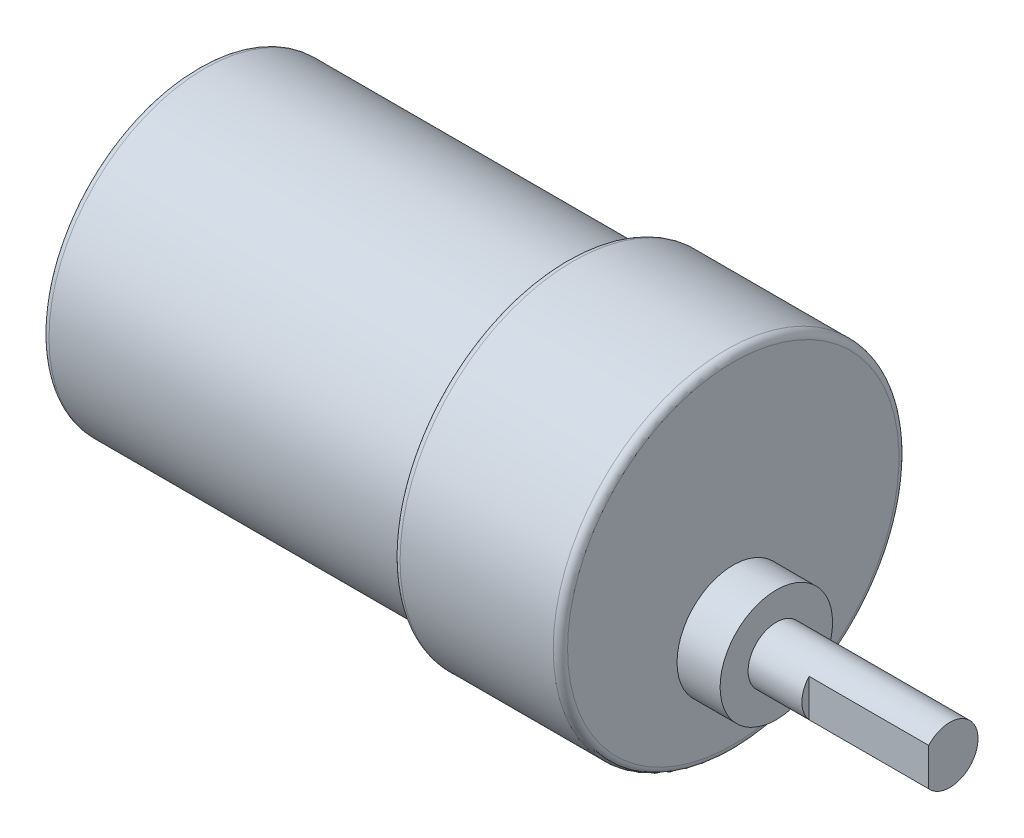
ISO-10303-21;
HEADER;
FILE_DESCRIPTION(('STEP AP214'),'2;1');
FILE_NAME('part.step','',(''),(''),'','','');
FILE_SCHEMA(('AUTOMOTIVE_DESIGN { 1 0 10303 214 1 1 1 1 }'));
ENDSEC;
DATA;
#1=APPLICATION_CONTEXT('core data for automotive mechanical design processes');
#2=APPLICATION_PROTOCOL_DEFINITION('international standard','automotive_design',2000,#1);
#3=PRODUCT_CONTEXT('',#1,'mechanical');
#4=PRODUCT('Part','Part','',(#3));
#5=PRODUCT_RELATED_PRODUCT_CATEGORY('part','',(#4));
#6=PRODUCT_DEFINITION_FORMATION('','',#4);
#7=PRODUCT_DEFINITION_CONTEXT('part definition',#1,'design');
#8=PRODUCT_DEFINITION('design','',#6,#7);
#9=PRODUCT_DEFINITION_SHAPE('','',#8);
#10=(LENGTH_UNIT() NAMED_UNIT(*) SI_UNIT(.MILLI.,.METRE.));
#11=(NAMED_UNIT(*) PLANE_ANGLE_UNIT() SI_UNIT($,.RADIAN.));
#12=(NAMED_UNIT(*) SI_UNIT($,.STERADIAN.) SOLID_ANGLE_UNIT());
#13=UNCERTAINTY_MEASURE_WITH_UNIT(LENGTH_MEASURE(1.E-05),#10,'distance_accuracy_value','');
#14=(GEOMETRIC_REPRESENTATION_CONTEXT(3) GLOBAL_UNCERTAINTY_ASSIGNED_CONTEXT((#13)) GLOBAL_UNIT_ASSIGNED_CONTEXT((#10,
#11,#12)) REPRESENTATION_CONTEXT('',''));
#15=CARTESIAN_POINT('',(0.,0.,0.));
#16=DIRECTION('',(0.,0.,1.));
#17=DIRECTION('',(1.,0.,0.));
#18=AXIS2_PLACEMENT_3D('',#15,#16,#17);
#19=CARTESIAN_POINT('',(61.468,-7.0358,0.));
#20=DIRECTION('',(1.,0.,0.));
#21=DIRECTION('',(0.,0.,-1.));
#22=AXIS2_PLACEMENT_3D('',#19,#20,#21);
#23=PLANE('',#22);
#24=CARTESIAN_POINT('',(61.468,-7.0358,0.));
#25=DIRECTION('',(1.,0.,0.));
#26=DIRECTION('',(0.,0.,-1.));
#27=AXIS2_PLACEMENT_3D('',#24,#25,#26);
#28=CIRCLE('',#27,5.969);
#29=CARTESIAN_POINT('',(61.468,-7.0358,-5.969));
#30=VERTEX_POINT('',#29);
#31=EDGE_CURVE('E72',#30,#30,#28,.T.);
#32=ORIENTED_EDGE('',*,*,#31,.T.);
#33=EDGE_LOOP('',(#32));
#34=FACE_BOUND('',#33,.T.);
#35=CARTESIAN_POINT('',(61.468,-7.0358,0.));
#36=DIRECTION('',(1.,0.,0.));
#37=DIRECTION('',(0.,0.,-1.));
#38=AXIS2_PLACEMENT_3D('',#35,#36,#37);
#39=CIRCLE('',#38,3.);
#40=CARTESIAN_POINT('',(61.468,-7.0358,-3.));
#41=VERTEX_POINT('',#40);
#42=EDGE_CURVE('E73',#41,#41,#39,.T.);
#43=ORIENTED_EDGE('',*,*,#42,.F.);
#44=EDGE_LOOP('',(#43));
#45=FACE_BOUND('',#44,.T.);
#46=ADVANCED_FACE('F34',(#34,#45),#23,.T.);
#47=CARTESIAN_POINT('',(56.896,18.3515,0.));
#48=DIRECTION('',(-1.,0.,0.));
#49=DIRECTION('',(0.,0.,1.));
#50=AXIS2_PLACEMENT_3D('',#47,#48,#49);
#51=PLANE('',#50);
#52=CARTESIAN_POINT('',(56.896,0.,0.));
#53=DIRECTION('',(-1.,0.,0.));
#54=DIRECTION('',(0.,0.,1.));
#55=AXIS2_PLACEMENT_3D('',#52,#53,#54);
#56=CIRCLE('',#55,17.5895);
#57=CARTESIAN_POINT('',(56.896,0.,17.5895));
#58=VERTEX_POINT('',#57);
#59=EDGE_CURVE('E96',#58,#58,#56,.F.);
#60=ORIENTED_EDGE('',*,*,#59,.T.);
#61=EDGE_LOOP('',(#60));
#62=FACE_BOUND('',#61,.T.);
#63=CARTESIAN_POINT('',(56.896,-7.0358,0.));
#64=DIRECTION('',(-1.,0.,0.));
#65=DIRECTION('',(0.,0.,1.));
#66=AXIS2_PLACEMENT_3D('',#63,#64,#65);
#67=CIRCLE('',#66,5.969);
#68=CARTESIAN_POINT('',(56.896,-7.0358,5.969));
#69=VERTEX_POINT('',#68);
#70=EDGE_CURVE('E87',#69,#69,#67,.F.);
#71=ORIENTED_EDGE('',*,*,#70,.F.);
#72=EDGE_LOOP('',(#71));
#73=FACE_BOUND('',#72,.T.);
#74=ADVANCED_FACE('F138',(#62,#73),#51,.F.);
#75=CARTESIAN_POINT('',(-2.286,0.,0.));
#76=DIRECTION('',(-1.,0.,0.));
#77=DIRECTION('',(0.,0.,1.));
#78=AXIS2_PLACEMENT_3D('',#75,#76,#77);
#79=CYLINDRICAL_SURFACE('',#78,16.51);
#80=CARTESIAN_POINT('',(0.762000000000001,0.,0.));
#81=DIRECTION('',(1.,0.,0.));
#82=DIRECTION('',(0.,0.,-1.));
#83=AXIS2_PLACEMENT_3D('',#80,#81,#82);
#84=CIRCLE('',#83,16.51);
#85=CARTESIAN_POINT('',(0.762000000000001,0.,-16.51));
#86=VERTEX_POINT('',#85);
#87=EDGE_CURVE('E105',#86,#86,#84,.T.);
#88=ORIENTED_EDGE('',*,*,#87,.T.);
#89=EDGE_LOOP('',(#88));
#90=FACE_BOUND('',#89,.T.);
#91=CARTESIAN_POINT('',(39.116,0.,0.));
#92=DIRECTION('',(-1.,0.,0.));
#93=DIRECTION('',(0.,0.,1.));
#94=AXIS2_PLACEMENT_3D('',#91,#92,#93);
#95=CIRCLE('',#94,16.51);
#96=CARTESIAN_POINT('',(39.116,0.,16.51));
#97=VERTEX_POINT('',#96);
#98=EDGE_CURVE('E76',#97,#97,#95,.T.);
#99=ORIENTED_EDGE('',*,*,#98,.T.);
#100=EDGE_LOOP('',(#99));
#101=FACE_BOUND('',#100,.T.);
#102=ADVANCED_FACE('F144',(#90,#101),#79,.T.);
#103=CARTESIAN_POINT('',(0.,3.175,0.));
#104=DIRECTION('',(1.,0.,0.));
#105=DIRECTION('',(0.,0.,-1.));
#106=AXIS2_PLACEMENT_3D('',#103,#104,#105);
#107=PLANE('',#106);
#108=CARTESIAN_POINT('',(0.,0.,0.));
#109=DIRECTION('',(1.,0.,0.));
#110=DIRECTION('',(0.,0.,-1.));
#111=AXIS2_PLACEMENT_3D('',#108,#109,#110);
#112=CIRCLE('',#111,15.748);
#113=CARTESIAN_POINT('',(0.,0.,-15.748));
#114=VERTEX_POINT('',#113);
#115=EDGE_CURVE('E102',#114,#114,#112,.F.);
#116=ORIENTED_EDGE('',*,*,#115,.T.);
#117=EDGE_LOOP('',(#116));
#118=FACE_BOUND('',#117,.T.);
#119=CARTESIAN_POINT('',(0.,0.,0.));
#120=DIRECTION('',(-1.,0.,0.));
#121=DIRECTION('',(0.,0.,1.));
#122=AXIS2_PLACEMENT_3D('',#119,#120,#121);
#123=CIRCLE('',#122,3.175);
#124=CARTESIAN_POINT('',(0.,0.,3.175));
#125=VERTEX_POINT('',#124);
#126=EDGE_CURVE('E84',#125,#125,#123,.T.);
#127=ORIENTED_EDGE('',*,*,#126,.F.);
#128=EDGE_LOOP('',(#127));
#129=FACE_BOUND('',#128,.T.);
#130=ADVANCED_FACE('F134',(#118,#129),#107,.F.);
#131=CARTESIAN_POINT('',(-2.286,0.,0.));
#132=DIRECTION('',(-1.,0.,0.));
#133=DIRECTION('',(0.,0.,1.));
#134=AXIS2_PLACEMENT_3D('',#131,#132,#133);
#135=CYLINDRICAL_SURFACE('',#134,3.175);
#136=CARTESIAN_POINT('',(-1.524,0.,0.));
#137=DIRECTION('',(1.,0.,0.));
#138=DIRECTION('',(0.,0.,-1.));
#139=AXIS2_PLACEMENT_3D('',#136,#137,#138);
#140=CIRCLE('',#139,3.175);
#141=CARTESIAN_POINT('',(-1.524,0.,-3.175));
#142=VERTEX_POINT('',#141);
#143=EDGE_CURVE('E64',#142,#142,#140,.T.);
#144=ORIENTED_EDGE('',*,*,#143,.T.);
#145=EDGE_LOOP('',(#144));
#146=FACE_BOUND('',#145,.T.);
#147=ORIENTED_EDGE('',*,*,#126,.T.);
#148=EDGE_LOOP('',(#147));
#149=FACE_BOUND('',#148,.T.);
#150=ADVANCED_FACE('F114',(#146,#149),#135,.T.);
#151=CARTESIAN_POINT('',(-2.286,3.175,0.));
#152=DIRECTION('',(1.,0.,0.));
#153=DIRECTION('',(0.,0.,-1.));
#154=AXIS2_PLACEMENT_3D('',#151,#152,#153);
#155=PLANE('',#154);
#156=CARTESIAN_POINT('',(-2.286,0.,0.));
#157=DIRECTION('',(1.,0.,0.));
#158=DIRECTION('',(0.,0.,-1.));
#159=AXIS2_PLACEMENT_3D('',#156,#157,#158);
#160=CIRCLE('',#159,2.413);
#161=CARTESIAN_POINT('',(-2.286,0.,-2.413));
#162=VERTEX_POINT('',#161);
#163=EDGE_CURVE('E108',#162,#162,#160,.F.);
#164=ORIENTED_EDGE('',*,*,#163,.T.);
#165=EDGE_LOOP('',(#164));
#166=FACE_BOUND('',#165,.T.);
#167=ADVANCED_FACE('F123',(#166),#155,.F.);
#168=CARTESIAN_POINT('',(-2.286,0.,0.));
#169=DIRECTION('',(-1.,0.,0.));
#170=DIRECTION('',(0.,0.,1.));
#171=AXIS2_PLACEMENT_3D('',#168,#169,#170);
#172=CYLINDRICAL_SURFACE('',#171,18.3515);
#173=CARTESIAN_POINT('',(56.134,0.,0.));
#174=DIRECTION('',(-1.,0.,0.));
#175=DIRECTION('',(0.,0.,1.));
#176=AXIS2_PLACEMENT_3D('',#173,#174,#175);
#177=CIRCLE('',#176,18.3515);
#178=CARTESIAN_POINT('',(56.134,0.,18.3515));
#179=VERTEX_POINT('',#178);
#180=EDGE_CURVE('E93',#179,#179,#177,.T.);
#181=ORIENTED_EDGE('',*,*,#180,.T.);
#182=EDGE_LOOP('',(#181));
#183=FACE_BOUND('',#182,.T.);
#184=CARTESIAN_POINT('',(39.878,0.,0.));
#185=DIRECTION('',(1.,0.,0.));
#186=DIRECTION('',(0.,0.,-1.));
#187=AXIS2_PLACEMENT_3D('',#184,#185,#186);
#188=CIRCLE('',#187,18.3515);
#189=CARTESIAN_POINT('',(39.878,0.,-18.3515));
#190=VERTEX_POINT('',#189);
#191=EDGE_CURVE('E90',#190,#190,#188,.T.);
#192=ORIENTED_EDGE('',*,*,#191,.T.);
#193=EDGE_LOOP('',(#192));
#194=FACE_BOUND('',#193,.T.);
#195=ADVANCED_FACE('F125',(#183,#194),#172,.T.);
#196=CARTESIAN_POINT('',(39.116,16.51,0.));
#197=DIRECTION('',(1.,0.,0.));
#198=DIRECTION('',(0.,0.,-1.));
#199=AXIS2_PLACEMENT_3D('',#196,#197,#198);
#200=PLANE('',#199);
#201=CARTESIAN_POINT('',(39.116,0.,0.));
#202=DIRECTION('',(1.,0.,0.));
#203=DIRECTION('',(0.,0.,-1.));
#204=AXIS2_PLACEMENT_3D('',#201,#202,#203);
#205=CIRCLE('',#204,17.5895);
#206=CARTESIAN_POINT('',(39.116,0.,-17.5895));
#207=VERTEX_POINT('',#206);
#208=EDGE_CURVE('E99',#207,#207,#205,.F.);
#209=ORIENTED_EDGE('',*,*,#208,.T.);
#210=EDGE_LOOP('',(#209));
#211=FACE_BOUND('',#210,.T.);
#212=ORIENTED_EDGE('',*,*,#98,.F.);
#213=EDGE_LOOP('',(#212));
#214=FACE_BOUND('',#213,.T.);
#215=ADVANCED_FACE('F131',(#211,#214),#200,.F.);
#216=CARTESIAN_POINT('',(61.468,-7.0358,0.));
#217=DIRECTION('',(-1.,0.,0.));
#218=DIRECTION('',(0.,0.,1.));
#219=AXIS2_PLACEMENT_3D('',#216,#217,#218);
#220=CYLINDRICAL_SURFACE('',#219,5.969);
#221=ORIENTED_EDGE('',*,*,#31,.F.);
#222=EDGE_LOOP('',(#221));
#223=FACE_BOUND('',#222,.T.);
#224=ORIENTED_EDGE('',*,*,#70,.T.);
#225=EDGE_LOOP('',(#224));
#226=FACE_BOUND('',#225,.T.);
#227=ADVANCED_FACE('F150',(#223,#226),#220,.T.);
#228=CARTESIAN_POINT('',(79.883,-7.0358,0.));
#229=DIRECTION('',(-1.,0.,0.));
#230=DIRECTION('',(0.,0.,1.));
#231=AXIS2_PLACEMENT_3D('',#228,#229,#230);
#232=CYLINDRICAL_SURFACE('',#231,3.);
#233=DIRECTION('',(-1.,0.,0.));
#234=VECTOR('',#233,1.);
#235=CARTESIAN_POINT('',(79.883,-9.03363783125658,2.238));
#236=LINE('',#235,#234);
#237=CARTESIAN_POINT('',(79.883,-9.03363783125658,2.238));
#238=VERTEX_POINT('',#237);
#239=CARTESIAN_POINT('',(67.183,-9.03363783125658,2.238));
#240=VERTEX_POINT('',#239);
#241=EDGE_CURVE('E49',#238,#240,#236,.T.);
#242=ORIENTED_EDGE('',*,*,#241,.T.);
#243=CARTESIAN_POINT('',(67.183,-7.0358,0.));
#244=DIRECTION('',(-1.,0.,0.));
#245=DIRECTION('',(0.,0.,1.));
#246=AXIS2_PLACEMENT_3D('',#243,#244,#245);
#247=CIRCLE('',#246,3.);
#248=CARTESIAN_POINT('',(67.183,-5.03796216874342,2.238));
#249=VERTEX_POINT('',#248);
#250=EDGE_CURVE('E11',#240,#249,#247,.T.);
#251=ORIENTED_EDGE('',*,*,#250,.T.);
#252=DIRECTION('',(-1.,0.,0.));
#253=VECTOR('',#252,1.);
#254=CARTESIAN_POINT('',(79.883,-5.03796216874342,2.238));
#255=LINE('',#254,#253);
#256=CARTESIAN_POINT('',(79.883,-5.03796216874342,2.238));
#257=VERTEX_POINT('',#256);
#258=EDGE_CURVE('E54',#249,#257,#255,.F.);
#259=ORIENTED_EDGE('',*,*,#258,.T.);
#260=CARTESIAN_POINT('',(79.883,-7.0358,0.));
#261=DIRECTION('',(1.,0.,0.));
#262=DIRECTION('',(0.,0.,-1.));
#263=AXIS2_PLACEMENT_3D('',#260,#261,#262);
#264=CIRCLE('',#263,3.);
#265=EDGE_CURVE('E68',#238,#257,#264,.T.);
#266=ORIENTED_EDGE('',*,*,#265,.F.);
#267=EDGE_LOOP('',(#242,#251,#259,#266));
#268=FACE_BOUND('',#267,.T.);
#269=ORIENTED_EDGE('',*,*,#42,.T.);
#270=EDGE_LOOP('',(#269));
#271=FACE_BOUND('',#270,.T.);
#272=ADVANCED_FACE('F66',(#268,#271),#232,.T.);
#273=CARTESIAN_POINT('',(79.883,-7.0358,0.));
#274=DIRECTION('',(1.,0.,0.));
#275=DIRECTION('',(0.,0.,-1.));
#276=AXIS2_PLACEMENT_3D('',#273,#274,#275);
#277=PLANE('',#276);
#278=DIRECTION('',(0.,1.,0.));
#279=VECTOR('',#278,1.);
#280=CARTESIAN_POINT('',(79.883,-7.0358,2.238));
#281=LINE('',#280,#279);
#282=EDGE_CURVE('E42',#238,#257,#281,.T.);
#283=ORIENTED_EDGE('',*,*,#282,.F.);
#284=ORIENTED_EDGE('',*,*,#265,.T.);
#285=EDGE_LOOP('',(#283,#284));
#286=FACE_BOUND('',#285,.T.);
#287=ADVANCED_FACE('F71',(#286),#277,.T.);
#288=CARTESIAN_POINT('',(56.134,0.,0.));
#289=DIRECTION('',(-1.,0.,0.));
#290=DIRECTION('',(0.,0.,1.));
#291=AXIS2_PLACEMENT_3D('',#288,#289,#290);
#292=TOROIDAL_SURFACE('',#291,17.5895,0.762);
#293=ORIENTED_EDGE('',*,*,#59,.F.);
#294=EDGE_LOOP('',(#293));
#295=FACE_BOUND('',#294,.T.);
#296=ORIENTED_EDGE('',*,*,#180,.F.);
#297=EDGE_LOOP('',(#296));
#298=FACE_BOUND('',#297,.T.);
#299=ADVANCED_FACE('F171',(#295,#298),#292,.T.);
#300=CARTESIAN_POINT('',(39.878,0.,0.));
#301=DIRECTION('',(1.,0.,0.));
#302=DIRECTION('',(0.,0.,-1.));
#303=AXIS2_PLACEMENT_3D('',#300,#301,#302);
#304=TOROIDAL_SURFACE('',#303,17.5895,0.762);
#305=ORIENTED_EDGE('',*,*,#191,.F.);
#306=EDGE_LOOP('',(#305));
#307=FACE_BOUND('',#306,.T.);
#308=ORIENTED_EDGE('',*,*,#208,.F.);
#309=EDGE_LOOP('',(#308));
#310=FACE_BOUND('',#309,.T.);
#311=ADVANCED_FACE('F174',(#307,#310),#304,.T.);
#312=CARTESIAN_POINT('',(0.762000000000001,0.,0.));
#313=DIRECTION('',(1.,0.,0.));
#314=DIRECTION('',(0.,0.,-1.));
#315=AXIS2_PLACEMENT_3D('',#312,#313,#314);
#316=TOROIDAL_SURFACE('',#315,15.748,0.762);
#317=ORIENTED_EDGE('',*,*,#87,.F.);
#318=EDGE_LOOP('',(#317));
#319=FACE_BOUND('',#318,.T.);
#320=ORIENTED_EDGE('',*,*,#115,.F.);
#321=EDGE_LOOP('',(#320));
#322=FACE_BOUND('',#321,.T.);
#323=ADVANCED_FACE('F120',(#319,#322),#316,.T.);
#324=CARTESIAN_POINT('',(-1.524,0.,0.));
#325=DIRECTION('',(1.,0.,0.));
#326=DIRECTION('',(0.,0.,-1.));
#327=AXIS2_PLACEMENT_3D('',#324,#325,#326);
#328=TOROIDAL_SURFACE('',#327,2.413,0.762);
#329=ORIENTED_EDGE('',*,*,#143,.F.);
#330=EDGE_LOOP('',(#329));
#331=FACE_BOUND('',#330,.T.);
#332=ORIENTED_EDGE('',*,*,#163,.F.);
#333=EDGE_LOOP('',(#332));
#334=FACE_BOUND('',#333,.T.);
#335=ADVANCED_FACE('F36',(#331,#334),#328,.T.);
#336=CARTESIAN_POINT('',(67.183,-18.3515,3.));
#337=DIRECTION('',(-1.,0.,0.));
#338=DIRECTION('',(0.,0.,1.));
#339=AXIS2_PLACEMENT_3D('',#336,#337,#338);
#340=PLANE('',#339);
#341=ORIENTED_EDGE('',*,*,#250,.F.);
#342=DIRECTION('',(0.,1.,0.));
#343=VECTOR('',#342,1.);
#344=CARTESIAN_POINT('',(67.183,-18.3515,2.238));
#345=LINE('',#344,#343);
#346=EDGE_CURVE('E69',#240,#249,#345,.T.);
#347=ORIENTED_EDGE('',*,*,#346,.T.);
#348=EDGE_LOOP('',(#341,#347));
#349=FACE_BOUND('',#348,.T.);
#350=ADVANCED_FACE('F119',(#349),#340,.F.);
#351=CARTESIAN_POINT('',(79.883,-18.3515,2.238));
#352=DIRECTION('',(0.,0.,-1.));
#353=DIRECTION('',(-1.,0.,0.));
#354=AXIS2_PLACEMENT_3D('',#351,#352,#353);
#355=PLANE('',#354);
#356=ORIENTED_EDGE('',*,*,#282,.T.);
#357=ORIENTED_EDGE('',*,*,#258,.F.);
#358=ORIENTED_EDGE('',*,*,#346,.F.);
#359=ORIENTED_EDGE('',*,*,#241,.F.);
#360=EDGE_LOOP('',(#356,#357,#358,#359));
#361=FACE_BOUND('',#360,.T.);
#362=ADVANCED_FACE('F60',(#361),#355,.F.);
#363=CLOSED_SHELL('',(#46,#74,#102,#130,#150,#167,#195,#215,#227,#272,#287,#299,#311,#323,#335,
#350,#362));
#364=MANIFOLD_SOLID_BREP('B2',#363);
#365=ADVANCED_BREP_SHAPE_REPRESENTATION('',(#18,#364),#14);
#366=SHAPE_DEFINITION_REPRESENTATION(#9,#365);
ENDSEC;
END-ISO-10303-21;
